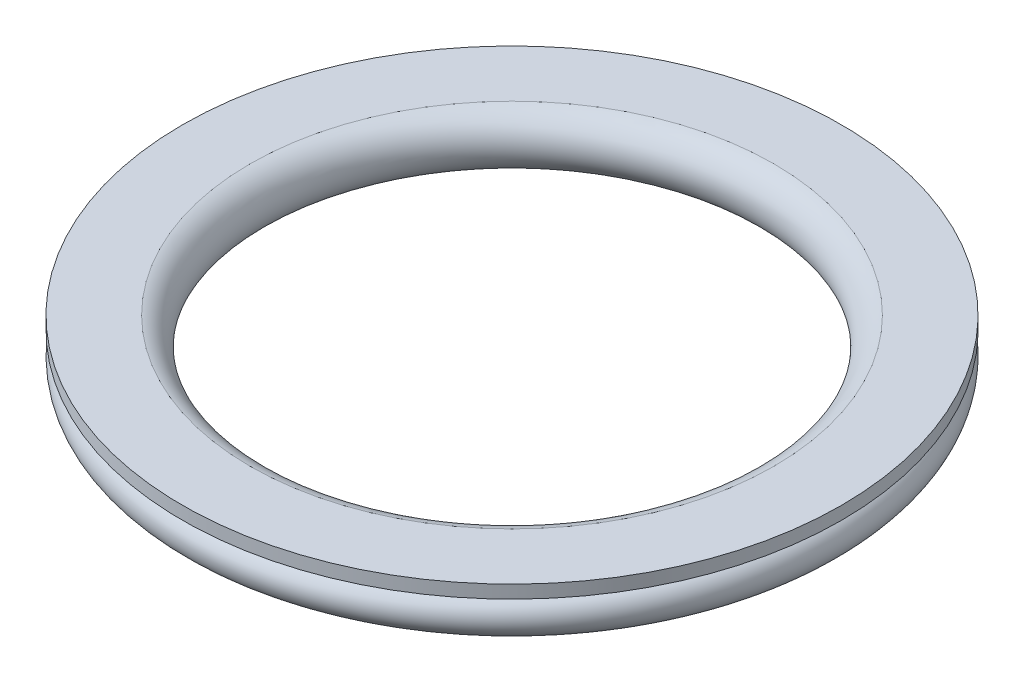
ISO-10303-21;
HEADER;
FILE_DESCRIPTION(('STEP AP214'),'2;1');
FILE_NAME('part.step','',(''),(''),'','','');
FILE_SCHEMA(('AUTOMOTIVE_DESIGN { 1 0 10303 214 1 1 1 1 }'));
ENDSEC;
DATA;
#1=APPLICATION_CONTEXT('core data for automotive mechanical design processes');
#2=APPLICATION_PROTOCOL_DEFINITION('international standard','automotive_design',2000,#1);
#3=PRODUCT_CONTEXT('',#1,'mechanical');
#4=PRODUCT('Part','Part','',(#3));
#5=PRODUCT_RELATED_PRODUCT_CATEGORY('part','',(#4));
#6=PRODUCT_DEFINITION_FORMATION('','',#4);
#7=PRODUCT_DEFINITION_CONTEXT('part definition',#1,'design');
#8=PRODUCT_DEFINITION('design','',#6,#7);
#9=PRODUCT_DEFINITION_SHAPE('','',#8);
#10=(LENGTH_UNIT() NAMED_UNIT(*) SI_UNIT(.MILLI.,.METRE.));
#11=(NAMED_UNIT(*) PLANE_ANGLE_UNIT() SI_UNIT($,.RADIAN.));
#12=(NAMED_UNIT(*) SI_UNIT($,.STERADIAN.) SOLID_ANGLE_UNIT());
#13=UNCERTAINTY_MEASURE_WITH_UNIT(LENGTH_MEASURE(1.E-05),#10,'distance_accuracy_value','');
#14=(GEOMETRIC_REPRESENTATION_CONTEXT(3) GLOBAL_UNCERTAINTY_ASSIGNED_CONTEXT((#13)) GLOBAL_UNIT_ASSIGNED_CONTEXT((#10,
#11,#12)) REPRESENTATION_CONTEXT('',''));
#15=CARTESIAN_POINT('',(0.,0.,0.));
#16=DIRECTION('',(0.,0.,1.));
#17=DIRECTION('',(1.,0.,0.));
#18=AXIS2_PLACEMENT_3D('',#15,#16,#17);
#19=CARTESIAN_POINT('',(-108.343696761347,-10.2736352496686,0.));
#20=DIRECTION('',(0.,-1.,0.));
#21=DIRECTION('',(1.,0.,0.));
#22=AXIS2_PLACEMENT_3D('',#19,#20,#21);
#23=PLANE('',#22);
#24=CARTESIAN_POINT('',(-76.6936967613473,-10.2736352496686,0.));
#25=DIRECTION('',(0.,1.,0.));
#26=DIRECTION('',(-1.,0.,0.));
#27=AXIS2_PLACEMENT_3D('',#24,#25,#26);
#28=CIRCLE('',#27,25.1558026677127);
#29=CARTESIAN_POINT('',(-101.84949942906,-10.2736352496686,0.));
#30=VERTEX_POINT('',#29);
#31=EDGE_CURVE('E10',#30,#30,#28,.T.);
#32=ORIENTED_EDGE('',*,*,#31,.T.);
#33=EDGE_LOOP('',(#32));
#34=FACE_BOUND('',#33,.T.);
#35=CARTESIAN_POINT('',(-76.6936967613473,-10.2736352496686,0.));
#36=DIRECTION('',(0.,1.,0.));
#37=DIRECTION('',(-1.,0.,0.));
#38=AXIS2_PLACEMENT_3D('',#35,#36,#37);
#39=CIRCLE('',#38,31.65);
#40=CARTESIAN_POINT('',(-108.343696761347,-10.2736352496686,0.));
#41=VERTEX_POINT('',#40);
#42=EDGE_CURVE('E61',#41,#41,#39,.T.);
#43=ORIENTED_EDGE('',*,*,#42,.F.);
#44=EDGE_LOOP('',(#43));
#45=FACE_BOUND('',#44,.T.);
#46=ADVANCED_FACE('F24',(#34,#45),#23,.T.);
#47=CARTESIAN_POINT('',(-76.6936967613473,-11.6746313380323,0.));
#48=DIRECTION('',(0.,1.,0.));
#49=DIRECTION('',(-1.,0.,0.));
#50=AXIS2_PLACEMENT_3D('',#47,#48,#49);
#51=TOROIDAL_SURFACE('',#50,25.5833726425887,1.46478876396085);
#52=ORIENTED_EDGE('',*,*,#31,.F.);
#53=EDGE_LOOP('',(#52));
#54=FACE_BOUND('',#53,.T.);
#55=CARTESIAN_POINT('',(-76.6936967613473,-12.7695207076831,0.));
#56=DIRECTION('',(0.,1.,0.));
#57=DIRECTION('',(-1.,0.,0.));
#58=AXIS2_PLACEMENT_3D('',#55,#56,#57);
#59=CIRCLE('',#58,26.5564211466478);
#60=CARTESIAN_POINT('',(-103.250117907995,-12.7695207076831,0.));
#61=VERTEX_POINT('',#60);
#62=EDGE_CURVE('E30',#61,#61,#59,.T.);
#63=ORIENTED_EDGE('',*,*,#62,.T.);
#64=EDGE_LOOP('',(#63));
#65=FACE_BOUND('',#64,.T.);
#66=ADVANCED_FACE('F68',(#54,#65),#51,.F.);
#67=CARTESIAN_POINT('',(-76.6936967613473,-10.9916515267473,0.));
#68=DIRECTION('',(0.,1.,0.));
#69=DIRECTION('',(-1.,0.,0.));
#70=AXIS2_PLACEMENT_3D('',#67,#68,#69);
#71=CONICAL_SURFACE('',#70,28.5569073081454,0.844249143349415);
#72=ORIENTED_EDGE('',*,*,#62,.F.);
#73=EDGE_LOOP('',(#72));
#74=FACE_BOUND('',#73,.T.);
#75=CARTESIAN_POINT('',(-76.6936967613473,-10.9916515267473,0.));
#76=DIRECTION('',(0.,1.,0.));
#77=DIRECTION('',(-1.,0.,0.));
#78=AXIS2_PLACEMENT_3D('',#75,#76,#77);
#79=CIRCLE('',#78,28.5569073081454);
#80=CARTESIAN_POINT('',(-105.250604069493,-10.9916515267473,0.));
#81=VERTEX_POINT('',#80);
#82=EDGE_CURVE('E34',#81,#81,#79,.T.);
#83=ORIENTED_EDGE('',*,*,#82,.T.);
#84=EDGE_LOOP('',(#83));
#85=FACE_BOUND('',#84,.T.);
#86=ADVANCED_FACE('F72',(#74,#85),#71,.F.);
#87=CARTESIAN_POINT('',(-76.6936967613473,-12.3799072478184,0.));
#88=DIRECTION('',(0.,1.,0.));
#89=DIRECTION('',(-1.,0.,0.));
#90=AXIS2_PLACEMENT_3D('',#87,#88,#89);
#91=TOROIDAL_SURFACE('',#90,29.7906759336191,1.85726653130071);
#92=CARTESIAN_POINT('',(-76.6936967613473,-14.1923367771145,0.));
#93=DIRECTION('',(0.,1.,0.));
#94=DIRECTION('',(-1.,0.,0.));
#95=AXIS2_PLACEMENT_3D('',#92,#93,#94);
#96=CIRCLE('',#95,29.3850428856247);
#97=CARTESIAN_POINT('',(-106.078739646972,-14.1923367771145,0.));
#98=VERTEX_POINT('',#97);
#99=EDGE_CURVE('E38',#98,#98,#96,.T.);
#100=ORIENTED_EDGE('',*,*,#99,.T.);
#101=EDGE_LOOP('',(#100));
#102=FACE_BOUND('',#101,.T.);
#103=ORIENTED_EDGE('',*,*,#82,.F.);
#104=EDGE_LOOP('',(#103));
#105=FACE_BOUND('',#104,.T.);
#106=ADVANCED_FACE('F77',(#102,#105),#91,.T.);
#107=CARTESIAN_POINT('',(-76.6936967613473,9.31607257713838,0.));
#108=DIRECTION('',(0.,1.,0.));
#109=DIRECTION('',(-1.,0.,0.));
#110=AXIS2_PLACEMENT_3D('',#107,#108,#109);
#111=CYLINDRICAL_SURFACE('',#110,29.3850428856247);
#112=CARTESIAN_POINT('',(-76.6936967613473,-13.1911563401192,0.));
#113=DIRECTION('',(0.,1.,0.));
#114=DIRECTION('',(-1.,0.,0.));
#115=AXIS2_PLACEMENT_3D('',#112,#113,#114);
#116=CIRCLE('',#115,29.3850428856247);
#117=CARTESIAN_POINT('',(-106.078739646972,-13.1911563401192,0.));
#118=VERTEX_POINT('',#117);
#119=EDGE_CURVE('E43',#118,#118,#116,.T.);
#120=ORIENTED_EDGE('',*,*,#119,.T.);
#121=EDGE_LOOP('',(#120));
#122=FACE_BOUND('',#121,.T.);
#123=ORIENTED_EDGE('',*,*,#99,.F.);
#124=EDGE_LOOP('',(#123));
#125=FACE_BOUND('',#124,.T.);
#126=ADVANCED_FACE('F83',(#122,#125),#111,.F.);
#127=CARTESIAN_POINT('',(-106.526465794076,-13.1911563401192,0.));
#128=DIRECTION('',(0.,-1.,0.));
#129=DIRECTION('',(1.,0.,0.));
#130=AXIS2_PLACEMENT_3D('',#127,#128,#129);
#131=PLANE('',#130);
#132=ORIENTED_EDGE('',*,*,#119,.F.);
#133=EDGE_LOOP('',(#132));
#134=FACE_BOUND('',#133,.T.);
#135=CARTESIAN_POINT('',(-76.6936967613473,-13.1911563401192,0.));
#136=DIRECTION('',(0.,1.,0.));
#137=DIRECTION('',(-1.,0.,0.));
#138=AXIS2_PLACEMENT_3D('',#135,#136,#137);
#139=CIRCLE('',#138,29.8327690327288);
#140=CARTESIAN_POINT('',(-106.526465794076,-13.1911563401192,0.));
#141=VERTEX_POINT('',#140);
#142=EDGE_CURVE('E46',#141,#141,#139,.T.);
#143=ORIENTED_EDGE('',*,*,#142,.T.);
#144=EDGE_LOOP('',(#143));
#145=FACE_BOUND('',#144,.T.);
#146=ADVANCED_FACE('F87',(#134,#145),#131,.F.);
#147=CARTESIAN_POINT('',(-76.6936967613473,-12.5171670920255,0.));
#148=DIRECTION('',(0.,1.,0.));
#149=DIRECTION('',(-1.,0.,0.));
#150=AXIS2_PLACEMENT_3D('',#147,#148,#149);
#151=TOROIDAL_SURFACE('',#150,29.8327690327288,0.673989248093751);
#152=ORIENTED_EDGE('',*,*,#142,.F.);
#153=EDGE_LOOP('',(#152));
#154=FACE_BOUND('',#153,.T.);
#155=CARTESIAN_POINT('',(-76.6936967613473,-12.013378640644,0.));
#156=DIRECTION('',(0.,1.,0.));
#157=DIRECTION('',(-1.,0.,0.));
#158=AXIS2_PLACEMENT_3D('',#155,#156,#157);
#159=CIRCLE('',#158,29.3850428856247);
#160=CARTESIAN_POINT('',(-106.078739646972,-12.013378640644,0.));
#161=VERTEX_POINT('',#160);
#162=EDGE_CURVE('E49',#161,#161,#159,.T.);
#163=ORIENTED_EDGE('',*,*,#162,.T.);
#164=EDGE_LOOP('',(#163));
#165=FACE_BOUND('',#164,.T.);
#166=ADVANCED_FACE('F91',(#154,#165),#151,.F.);
#167=CARTESIAN_POINT('',(-76.6936967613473,-12.013378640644,0.));
#168=DIRECTION('',(0.,1.,0.));
#169=DIRECTION('',(-1.,0.,0.));
#170=AXIS2_PLACEMENT_3D('',#167,#168,#169);
#171=CONICAL_SURFACE('',#170,29.3850428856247,0.844249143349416);
#172=CARTESIAN_POINT('',(-76.6936967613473,-13.6894122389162,0.));
#173=DIRECTION('',(0.,1.,0.));
#174=DIRECTION('',(-1.,0.,0.));
#175=AXIS2_PLACEMENT_3D('',#172,#173,#174);
#176=CIRCLE('',#175,27.4991437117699);
#177=CARTESIAN_POINT('',(-104.192840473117,-13.6894122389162,0.));
#178=VERTEX_POINT('',#177);
#179=EDGE_CURVE('E52',#178,#178,#176,.T.);
#180=ORIENTED_EDGE('',*,*,#179,.T.);
#181=EDGE_LOOP('',(#180));
#182=FACE_BOUND('',#181,.T.);
#183=ORIENTED_EDGE('',*,*,#162,.F.);
#184=EDGE_LOOP('',(#183));
#185=FACE_BOUND('',#184,.T.);
#186=ADVANCED_FACE('F95',(#182,#185),#171,.T.);
#187=CARTESIAN_POINT('',(-76.6936967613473,-11.6696050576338,0.));
#188=DIRECTION('',(0.,1.,0.));
#189=DIRECTION('',(-1.,0.,0.));
#190=AXIS2_PLACEMENT_3D('',#187,#188,#189);
#191=TOROIDAL_SURFACE('',#190,25.7041035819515,2.70218247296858);
#192=CARTESIAN_POINT('',(-76.6936967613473,-9.02363524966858,0.));
#193=DIRECTION('',(0.,1.,0.));
#194=DIRECTION('',(-1.,0.,0.));
#195=AXIS2_PLACEMENT_3D('',#192,#193,#194);
#196=CIRCLE('',#195,25.1558026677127);
#197=CARTESIAN_POINT('',(-101.84949942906,-9.02363524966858,0.));
#198=VERTEX_POINT('',#197);
#199=EDGE_CURVE('E55',#198,#198,#196,.T.);
#200=ORIENTED_EDGE('',*,*,#199,.T.);
#201=EDGE_LOOP('',(#200));
#202=FACE_BOUND('',#201,.T.);
#203=ORIENTED_EDGE('',*,*,#179,.F.);
#204=EDGE_LOOP('',(#203));
#205=FACE_BOUND('',#204,.T.);
#206=ADVANCED_FACE('F99',(#202,#205),#191,.T.);
#207=CARTESIAN_POINT('',(-108.343696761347,-9.02363524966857,0.));
#208=DIRECTION('',(0.,-1.,0.));
#209=DIRECTION('',(1.,0.,0.));
#210=AXIS2_PLACEMENT_3D('',#207,#208,#209);
#211=PLANE('',#210);
#212=ORIENTED_EDGE('',*,*,#199,.F.);
#213=EDGE_LOOP('',(#212));
#214=FACE_BOUND('',#213,.T.);
#215=CARTESIAN_POINT('',(-76.6936967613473,-9.02363524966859,0.));
#216=DIRECTION('',(0.,1.,0.));
#217=DIRECTION('',(-1.,0.,0.));
#218=AXIS2_PLACEMENT_3D('',#215,#216,#217);
#219=CIRCLE('',#218,31.65);
#220=CARTESIAN_POINT('',(-108.343696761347,-9.02363524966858,0.));
#221=VERTEX_POINT('',#220);
#222=EDGE_CURVE('E58',#221,#221,#219,.T.);
#223=ORIENTED_EDGE('',*,*,#222,.T.);
#224=EDGE_LOOP('',(#223));
#225=FACE_BOUND('',#224,.T.);
#226=ADVANCED_FACE('F103',(#214,#225),#211,.F.);
#227=CARTESIAN_POINT('',(-76.6936967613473,9.31607257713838,0.));
#228=DIRECTION('',(0.,1.,0.));
#229=DIRECTION('',(-1.,0.,0.));
#230=AXIS2_PLACEMENT_3D('',#227,#228,#229);
#231=CYLINDRICAL_SURFACE('',#230,31.65);
#232=ORIENTED_EDGE('',*,*,#222,.F.);
#233=EDGE_LOOP('',(#232));
#234=FACE_BOUND('',#233,.T.);
#235=ORIENTED_EDGE('',*,*,#42,.T.);
#236=EDGE_LOOP('',(#235));
#237=FACE_BOUND('',#236,.T.);
#238=ADVANCED_FACE('F65',(#234,#237),#231,.T.);
#239=CLOSED_SHELL('',(#46,#66,#86,#106,#126,#146,#166,#186,#206,#226,#238));
#240=MANIFOLD_SOLID_BREP('B2',#239);
#241=ADVANCED_BREP_SHAPE_REPRESENTATION('',(#18,#240),#14);
#242=SHAPE_DEFINITION_REPRESENTATION(#9,#241);
ENDSEC;
END-ISO-10303-21;
